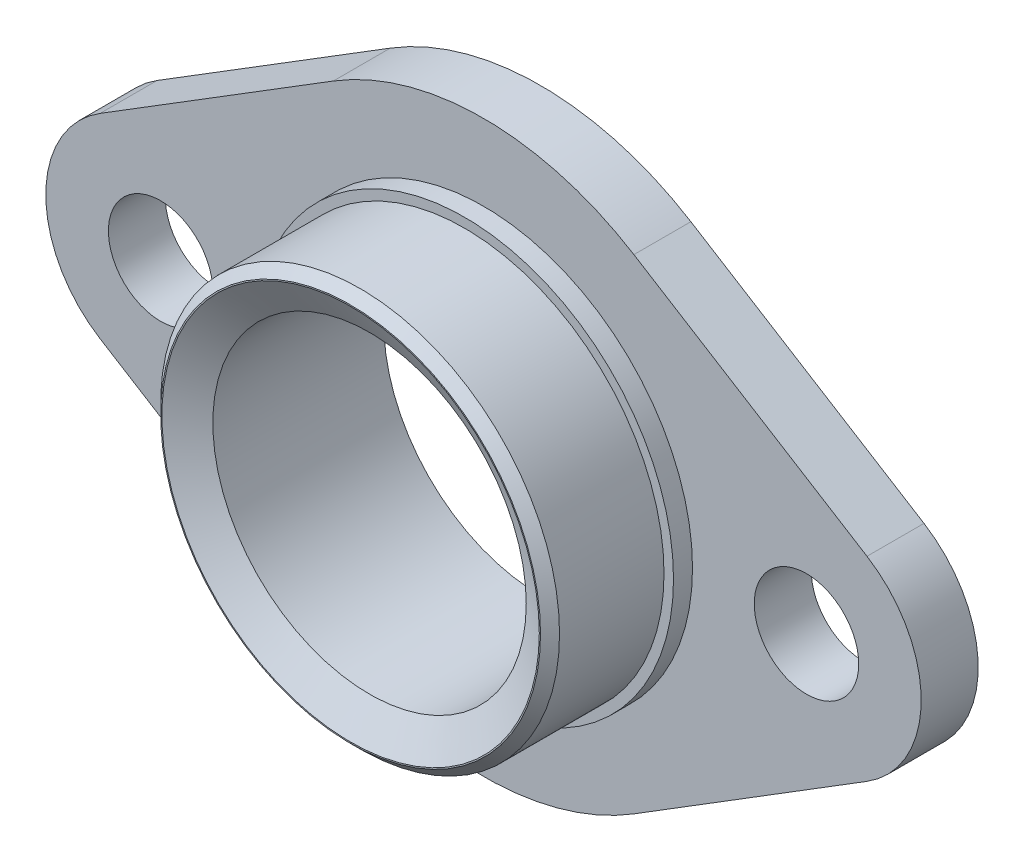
ISO-10303-21;
HEADER;
FILE_DESCRIPTION(('STEP AP214'),'2;1');
FILE_NAME('part.step','',(''),(''),'','','');
FILE_SCHEMA(('AUTOMOTIVE_DESIGN { 1 0 10303 214 1 1 1 1 }'));
ENDSEC;
DATA;
#1=APPLICATION_CONTEXT('core data for automotive mechanical design processes');
#2=APPLICATION_PROTOCOL_DEFINITION('international standard','automotive_design',2000,#1);
#3=PRODUCT_CONTEXT('',#1,'mechanical');
#4=PRODUCT('Part','Part','',(#3));
#5=PRODUCT_RELATED_PRODUCT_CATEGORY('part','',(#4));
#6=PRODUCT_DEFINITION_FORMATION('','',#4);
#7=PRODUCT_DEFINITION_CONTEXT('part definition',#1,'design');
#8=PRODUCT_DEFINITION('design','',#6,#7);
#9=PRODUCT_DEFINITION_SHAPE('','',#8);
#10=(LENGTH_UNIT() NAMED_UNIT(*) SI_UNIT(.MILLI.,.METRE.));
#11=(NAMED_UNIT(*) PLANE_ANGLE_UNIT() SI_UNIT($,.RADIAN.));
#12=(NAMED_UNIT(*) SI_UNIT($,.STERADIAN.) SOLID_ANGLE_UNIT());
#13=UNCERTAINTY_MEASURE_WITH_UNIT(LENGTH_MEASURE(1.E-05),#10,'distance_accuracy_value','');
#14=(GEOMETRIC_REPRESENTATION_CONTEXT(3) GLOBAL_UNCERTAINTY_ASSIGNED_CONTEXT((#13)) GLOBAL_UNIT_ASSIGNED_CONTEXT((#10,
#11,#12)) REPRESENTATION_CONTEXT('',''));
#15=CARTESIAN_POINT('',(0.,0.,0.));
#16=DIRECTION('',(0.,0.,1.));
#17=DIRECTION('',(1.,0.,0.));
#18=AXIS2_PLACEMENT_3D('',#15,#16,#17);
#19=CARTESIAN_POINT('',(0.,0.,6.));
#20=DIRECTION('',(0.,0.,-1.));
#21=DIRECTION('',(-1.,0.,0.));
#22=AXIS2_PLACEMENT_3D('',#19,#20,#21);
#23=CYLINDRICAL_SURFACE('',#22,16.5);
#24=CARTESIAN_POINT('',(0.,0.,0.));
#25=DIRECTION('',(0.,0.,1.));
#26=DIRECTION('',(1.,0.,0.));
#27=AXIS2_PLACEMENT_3D('',#24,#25,#26);
#28=CIRCLE('',#27,16.5);
#29=CARTESIAN_POINT('',(16.5,0.,0.));
#30=VERTEX_POINT('',#29);
#31=EDGE_CURVE('E388',#30,#30,#28,.T.);
#32=ORIENTED_EDGE('',*,*,#31,.F.);
#33=EDGE_LOOP('',(#32));
#34=FACE_BOUND('',#33,.T.);
#35=CARTESIAN_POINT('',(0.,0.,18.0047990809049));
#36=DIRECTION('',(0.,0.,1.));
#37=DIRECTION('',(1.,0.,0.));
#38=AXIS2_PLACEMENT_3D('',#35,#36,#37);
#39=CIRCLE('',#38,16.5);
#40=CARTESIAN_POINT('',(16.5,0.,18.0047990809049));
#41=VERTEX_POINT('',#40);
#42=EDGE_CURVE('E409',#41,#41,#39,.T.);
#43=ORIENTED_EDGE('',*,*,#42,.T.);
#44=EDGE_LOOP('',(#43));
#45=FACE_BOUND('',#44,.T.);
#46=ADVANCED_FACE('F31',(#34,#45),#23,.F.);
#47=CARTESIAN_POINT('',(0.,0.,20.));
#48=DIRECTION('',(0.,0.,1.));
#49=DIRECTION('',(1.,0.,0.));
#50=AXIS2_PLACEMENT_3D('',#47,#48,#49);
#51=PLANE('',#50);
#52=CARTESIAN_POINT('',(0.,0.,20.));
#53=DIRECTION('',(0.,0.,1.));
#54=DIRECTION('',(1.,0.,0.));
#55=AXIS2_PLACEMENT_3D('',#52,#53,#54);
#56=CIRCLE('',#55,20.);
#57=CARTESIAN_POINT('',(20.,0.,20.));
#58=VERTEX_POINT('',#57);
#59=EDGE_CURVE('E40',#58,#58,#56,.T.);
#60=ORIENTED_EDGE('',*,*,#59,.T.);
#61=EDGE_LOOP('',(#60));
#62=FACE_BOUND('',#61,.T.);
#63=CARTESIAN_POINT('',(0.,0.,20.));
#64=DIRECTION('',(0.,0.,1.));
#65=DIRECTION('',(1.,0.,0.));
#66=AXIS2_PLACEMENT_3D('',#63,#64,#65);
#67=CIRCLE('',#66,19.8680373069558);
#68=CARTESIAN_POINT('',(19.8680373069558,0.,20.));
#69=VERTEX_POINT('',#68);
#70=EDGE_CURVE('E35',#69,#69,#67,.F.);
#71=ORIENTED_EDGE('',*,*,#70,.T.);
#72=EDGE_LOOP('',(#71));
#73=FACE_BOUND('',#72,.T.);
#74=ADVANCED_FACE('F171',(#62,#73),#51,.T.);
#75=CARTESIAN_POINT('',(0.,0.,8.));
#76=DIRECTION('',(0.,0.,1.));
#77=DIRECTION('',(1.,0.,0.));
#78=AXIS2_PLACEMENT_3D('',#75,#76,#77);
#79=PLANE('',#78);
#80=CARTESIAN_POINT('',(0.,0.,8.));
#81=DIRECTION('',(0.,0.,1.));
#82=DIRECTION('',(1.,0.,0.));
#83=AXIS2_PLACEMENT_3D('',#80,#81,#82);
#84=CIRCLE('',#83,22.);
#85=CARTESIAN_POINT('',(22.,0.,8.));
#86=VERTEX_POINT('',#85);
#87=EDGE_CURVE('E381',#86,#86,#84,.T.);
#88=ORIENTED_EDGE('',*,*,#87,.T.);
#89=EDGE_LOOP('',(#88));
#90=FACE_BOUND('',#89,.T.);
#91=CARTESIAN_POINT('',(0.,0.,8.));
#92=DIRECTION('',(0.,0.,1.));
#93=DIRECTION('',(1.,0.,0.));
#94=AXIS2_PLACEMENT_3D('',#91,#92,#93);
#95=CIRCLE('',#94,21.);
#96=CARTESIAN_POINT('',(21.,0.,8.));
#97=VERTEX_POINT('',#96);
#98=EDGE_CURVE('E386',#97,#97,#95,.T.);
#99=ORIENTED_EDGE('',*,*,#98,.F.);
#100=EDGE_LOOP('',(#99));
#101=FACE_BOUND('',#100,.T.);
#102=ADVANCED_FACE('F197',(#90,#101),#79,.T.);
#103=CARTESIAN_POINT('',(34.,0.,6.));
#104=DIRECTION('',(0.,0.,1.));
#105=DIRECTION('',(1.,0.,0.));
#106=AXIS2_PLACEMENT_3D('',#103,#104,#105);
#107=PLANE('',#106);
#108=CARTESIAN_POINT('',(-34.,0.,6.));
#109=DIRECTION('',(0.,0.,1.));
#110=DIRECTION('',(1.,0.,0.));
#111=AXIS2_PLACEMENT_3D('',#108,#109,#110);
#112=CIRCLE('',#111,5.5);
#113=CARTESIAN_POINT('',(-28.5,0.,6.));
#114=VERTEX_POINT('',#113);
#115=EDGE_CURVE('E120',#114,#114,#112,.T.);
#116=ORIENTED_EDGE('',*,*,#115,.F.);
#117=EDGE_LOOP('',(#116));
#118=FACE_BOUND('',#117,.T.);
#119=CARTESIAN_POINT('',(34.,0.,6.));
#120=DIRECTION('',(0.,0.,1.));
#121=DIRECTION('',(1.,0.,0.));
#122=AXIS2_PLACEMENT_3D('',#119,#120,#121);
#123=CIRCLE('',#122,12.0790076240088);
#124=CARTESIAN_POINT('',(40.3705967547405,-10.2624520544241,6.));
#125=VERTEX_POINT('',#124);
#126=CARTESIAN_POINT('',(40.3705967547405,10.2624520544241,6.));
#127=VERTEX_POINT('',#126);
#128=EDGE_CURVE('E138',#125,#127,#123,.T.);
#129=ORIENTED_EDGE('',*,*,#128,.T.);
#130=DIRECTION('',(-0.849610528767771,0.527410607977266,0.));
#131=VECTOR('',#130,1.);
#132=CARTESIAN_POINT('',(15.8281030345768,25.4976346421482,6.));
#133=LINE('',#132,#131);
#134=CARTESIAN_POINT('',(15.8281030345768,25.4976346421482,6.));
#135=VERTEX_POINT('',#134);
#136=EDGE_CURVE('E113',#127,#135,#133,.T.);
#137=ORIENTED_EDGE('',*,*,#136,.T.);
#138=CARTESIAN_POINT('',(0.,0.,6.));
#139=DIRECTION('',(0.,0.,1.));
#140=DIRECTION('',(1.,0.,0.));
#141=AXIS2_PLACEMENT_3D('',#138,#139,#140);
#142=CIRCLE('',#141,30.0109682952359);
#143=CARTESIAN_POINT('',(-15.8176131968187,25.504143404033,6.));
#144=VERTEX_POINT('',#143);
#145=EDGE_CURVE('E141',#135,#144,#142,.T.);
#146=ORIENTED_EDGE('',*,*,#145,.T.);
#147=DIRECTION('',(-0.849827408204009,-0.527061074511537,0.));
#148=VECTOR('',#147,1.);
#149=CARTESIAN_POINT('',(-15.8176131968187,25.504143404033,6.));
#150=LINE('',#149,#148);
#151=CARTESIAN_POINT('',(-40.3726384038,10.2751712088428,6.));
#152=VERTEX_POINT('',#151);
#153=EDGE_CURVE('E143',#144,#152,#150,.T.);
#154=ORIENTED_EDGE('',*,*,#153,.T.);
#155=CARTESIAN_POINT('',(-34.,0.,6.));
#156=DIRECTION('',(0.,0.,1.));
#157=DIRECTION('',(1.,0.,0.));
#158=AXIS2_PLACEMENT_3D('',#155,#156,#157);
#159=CIRCLE('',#158,12.0908917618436);
#160=CARTESIAN_POINT('',(-40.3726384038,-10.2751712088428,6.));
#161=VERTEX_POINT('',#160);
#162=EDGE_CURVE('E145',#152,#161,#159,.T.);
#163=ORIENTED_EDGE('',*,*,#162,.T.);
#164=DIRECTION('',(0.849827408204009,-0.527061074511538,0.));
#165=VECTOR('',#164,1.);
#166=CARTESIAN_POINT('',(-15.8176131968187,-25.504143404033,6.));
#167=LINE('',#166,#165);
#168=CARTESIAN_POINT('',(-15.8176131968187,-25.504143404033,6.));
#169=VERTEX_POINT('',#168);
#170=EDGE_CURVE('E147',#161,#169,#167,.T.);
#171=ORIENTED_EDGE('',*,*,#170,.T.);
#172=CARTESIAN_POINT('',(0.,0.,6.));
#173=DIRECTION('',(0.,0.,1.));
#174=DIRECTION('',(-1.,0.,0.));
#175=AXIS2_PLACEMENT_3D('',#172,#173,#174);
#176=CIRCLE('',#175,30.0109682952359);
#177=CARTESIAN_POINT('',(15.8281030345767,-25.4976346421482,6.));
#178=VERTEX_POINT('',#177);
#179=EDGE_CURVE('E52',#169,#178,#176,.T.);
#180=ORIENTED_EDGE('',*,*,#179,.T.);
#181=DIRECTION('',(0.849610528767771,0.527410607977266,0.));
#182=VECTOR('',#181,1.);
#183=CARTESIAN_POINT('',(15.8281030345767,-25.4976346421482,6.));
#184=LINE('',#183,#182);
#185=EDGE_CURVE('E47',#178,#125,#184,.T.);
#186=ORIENTED_EDGE('',*,*,#185,.T.);
#187=EDGE_LOOP('',(#129,#137,#146,#154,#163,#171,#180,#186));
#188=FACE_BOUND('',#187,.T.);
#189=CARTESIAN_POINT('',(34.,0.,6.));
#190=DIRECTION('',(0.,0.,1.));
#191=DIRECTION('',(1.,0.,0.));
#192=AXIS2_PLACEMENT_3D('',#189,#190,#191);
#193=CIRCLE('',#192,5.5);
#194=CARTESIAN_POINT('',(39.5,0.,6.));
#195=VERTEX_POINT('',#194);
#196=EDGE_CURVE('E399',#195,#195,#193,.T.);
#197=ORIENTED_EDGE('',*,*,#196,.F.);
#198=EDGE_LOOP('',(#197));
#199=FACE_BOUND('',#198,.T.);
#200=CARTESIAN_POINT('',(0.,0.,6.));
#201=DIRECTION('',(0.,0.,1.));
#202=DIRECTION('',(1.,0.,0.));
#203=AXIS2_PLACEMENT_3D('',#200,#201,#202);
#204=CIRCLE('',#203,22.);
#205=CARTESIAN_POINT('',(22.,0.,6.));
#206=VERTEX_POINT('',#205);
#207=EDGE_CURVE('E384',#206,#206,#204,.T.);
#208=ORIENTED_EDGE('',*,*,#207,.F.);
#209=EDGE_LOOP('',(#208));
#210=FACE_BOUND('',#209,.T.);
#211=ADVANCED_FACE('F214',(#118,#188,#199,#210),#107,.T.);
#212=CARTESIAN_POINT('',(34.,0.,0.));
#213=DIRECTION('',(0.,0.,1.));
#214=DIRECTION('',(1.,0.,0.));
#215=AXIS2_PLACEMENT_3D('',#212,#213,#214);
#216=PLANE('',#215);
#217=CARTESIAN_POINT('',(34.,0.,0.));
#218=DIRECTION('',(0.,0.,1.));
#219=DIRECTION('',(1.,0.,0.));
#220=AXIS2_PLACEMENT_3D('',#217,#218,#219);
#221=CIRCLE('',#220,5.5);
#222=CARTESIAN_POINT('',(39.5,0.,0.));
#223=VERTEX_POINT('',#222);
#224=EDGE_CURVE('E396',#223,#223,#221,.T.);
#225=ORIENTED_EDGE('',*,*,#224,.T.);
#226=EDGE_LOOP('',(#225));
#227=FACE_BOUND('',#226,.T.);
#228=CARTESIAN_POINT('',(34.,0.,0.));
#229=DIRECTION('',(0.,0.,1.));
#230=DIRECTION('',(1.,0.,0.));
#231=AXIS2_PLACEMENT_3D('',#228,#229,#230);
#232=CIRCLE('',#231,12.0790076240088);
#233=CARTESIAN_POINT('',(40.3705967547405,-10.2624520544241,0.));
#234=VERTEX_POINT('',#233);
#235=CARTESIAN_POINT('',(40.3705967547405,10.2624520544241,0.));
#236=VERTEX_POINT('',#235);
#237=EDGE_CURVE('E103',#234,#236,#232,.T.);
#238=ORIENTED_EDGE('',*,*,#237,.F.);
#239=DIRECTION('',(0.849610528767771,0.527410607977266,0.));
#240=VECTOR('',#239,1.);
#241=CARTESIAN_POINT('',(15.8281030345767,-25.4976346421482,0.));
#242=LINE('',#241,#240);
#243=CARTESIAN_POINT('',(15.8281030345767,-25.4976346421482,0.));
#244=VERTEX_POINT('',#243);
#245=EDGE_CURVE('E136',#244,#234,#242,.T.);
#246=ORIENTED_EDGE('',*,*,#245,.F.);
#247=CARTESIAN_POINT('',(0.,0.,0.));
#248=DIRECTION('',(0.,0.,1.));
#249=DIRECTION('',(-1.,0.,0.));
#250=AXIS2_PLACEMENT_3D('',#247,#248,#249);
#251=CIRCLE('',#250,30.0109682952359);
#252=CARTESIAN_POINT('',(-15.8176131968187,-25.504143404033,0.));
#253=VERTEX_POINT('',#252);
#254=EDGE_CURVE('E134',#253,#244,#251,.T.);
#255=ORIENTED_EDGE('',*,*,#254,.F.);
#256=DIRECTION('',(0.849827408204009,-0.527061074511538,0.));
#257=VECTOR('',#256,1.);
#258=CARTESIAN_POINT('',(-15.8176131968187,-25.504143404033,0.));
#259=LINE('',#258,#257);
#260=CARTESIAN_POINT('',(-40.3726384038,-10.2751712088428,0.));
#261=VERTEX_POINT('',#260);
#262=EDGE_CURVE('E132',#261,#253,#259,.T.);
#263=ORIENTED_EDGE('',*,*,#262,.F.);
#264=CARTESIAN_POINT('',(-34.,0.,0.));
#265=DIRECTION('',(0.,0.,1.));
#266=DIRECTION('',(1.,0.,0.));
#267=AXIS2_PLACEMENT_3D('',#264,#265,#266);
#268=CIRCLE('',#267,12.0908917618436);
#269=CARTESIAN_POINT('',(-40.3726384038,10.2751712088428,0.));
#270=VERTEX_POINT('',#269);
#271=EDGE_CURVE('E130',#270,#261,#268,.T.);
#272=ORIENTED_EDGE('',*,*,#271,.F.);
#273=DIRECTION('',(-0.849827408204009,-0.527061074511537,0.));
#274=VECTOR('',#273,1.);
#275=CARTESIAN_POINT('',(-15.8176131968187,25.504143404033,0.));
#276=LINE('',#275,#274);
#277=CARTESIAN_POINT('',(-15.8176131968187,25.504143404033,0.));
#278=VERTEX_POINT('',#277);
#279=EDGE_CURVE('E128',#278,#270,#276,.T.);
#280=ORIENTED_EDGE('',*,*,#279,.F.);
#281=CARTESIAN_POINT('',(0.,0.,0.));
#282=DIRECTION('',(0.,0.,1.));
#283=DIRECTION('',(1.,0.,0.));
#284=AXIS2_PLACEMENT_3D('',#281,#282,#283);
#285=CIRCLE('',#284,30.0109682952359);
#286=CARTESIAN_POINT('',(15.8281030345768,25.4976346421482,0.));
#287=VERTEX_POINT('',#286);
#288=EDGE_CURVE('E105',#287,#278,#285,.T.);
#289=ORIENTED_EDGE('',*,*,#288,.F.);
#290=DIRECTION('',(-0.849610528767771,0.527410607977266,0.));
#291=VECTOR('',#290,1.);
#292=CARTESIAN_POINT('',(15.8281030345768,25.4976346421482,0.));
#293=LINE('',#292,#291);
#294=EDGE_CURVE('E97',#236,#287,#293,.T.);
#295=ORIENTED_EDGE('',*,*,#294,.F.);
#296=EDGE_LOOP('',(#238,#246,#255,#263,#272,#280,#289,#295));
#297=FACE_BOUND('',#296,.T.);
#298=CARTESIAN_POINT('',(-34.,0.,0.));
#299=DIRECTION('',(0.,0.,1.));
#300=DIRECTION('',(1.,0.,0.));
#301=AXIS2_PLACEMENT_3D('',#298,#299,#300);
#302=CIRCLE('',#301,5.5);
#303=CARTESIAN_POINT('',(-28.5,0.,0.));
#304=VERTEX_POINT('',#303);
#305=EDGE_CURVE('E123',#304,#304,#302,.T.);
#306=ORIENTED_EDGE('',*,*,#305,.T.);
#307=EDGE_LOOP('',(#306));
#308=FACE_BOUND('',#307,.T.);
#309=ORIENTED_EDGE('',*,*,#31,.T.);
#310=EDGE_LOOP('',(#309));
#311=FACE_BOUND('',#310,.T.);
#312=ADVANCED_FACE('F99',(#227,#297,#308,#311),#216,.F.);
#313=CARTESIAN_POINT('',(34.,0.,6.));
#314=DIRECTION('',(0.,0.,-1.));
#315=DIRECTION('',(-1.,0.,0.));
#316=AXIS2_PLACEMENT_3D('',#313,#314,#315);
#317=CYLINDRICAL_SURFACE('',#316,12.0790076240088);
#318=ORIENTED_EDGE('',*,*,#237,.T.);
#319=DIRECTION('',(0.,0.,-1.));
#320=VECTOR('',#319,1.);
#321=CARTESIAN_POINT('',(40.3705967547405,10.2624520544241,6.));
#322=LINE('',#321,#320);
#323=EDGE_CURVE('E111',#127,#236,#322,.T.);
#324=ORIENTED_EDGE('',*,*,#323,.F.);
#325=ORIENTED_EDGE('',*,*,#128,.F.);
#326=DIRECTION('',(0.,0.,-1.));
#327=VECTOR('',#326,1.);
#328=CARTESIAN_POINT('',(40.3705967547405,-10.2624520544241,6.));
#329=LINE('',#328,#327);
#330=EDGE_CURVE('E119',#125,#234,#329,.T.);
#331=ORIENTED_EDGE('',*,*,#330,.T.);
#332=EDGE_LOOP('',(#318,#324,#325,#331));
#333=FACE_BOUND('',#332,.T.);
#334=ADVANCED_FACE('F33',(#333),#317,.T.);
#335=CARTESIAN_POINT('',(15.8281030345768,25.4976346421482,6.));
#336=DIRECTION('',(-0.527410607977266,-0.84961052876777,0.));
#337=DIRECTION('',(0.849610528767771,-0.527410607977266,0.));
#338=AXIS2_PLACEMENT_3D('',#335,#336,#337);
#339=PLANE('',#338);
#340=ORIENTED_EDGE('',*,*,#294,.T.);
#341=DIRECTION('',(0.,0.,-1.));
#342=VECTOR('',#341,1.);
#343=CARTESIAN_POINT('',(15.8281030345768,25.4976346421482,6.));
#344=LINE('',#343,#342);
#345=EDGE_CURVE('E116',#135,#287,#344,.T.);
#346=ORIENTED_EDGE('',*,*,#345,.F.);
#347=ORIENTED_EDGE('',*,*,#136,.F.);
#348=ORIENTED_EDGE('',*,*,#323,.T.);
#349=EDGE_LOOP('',(#340,#346,#347,#348));
#350=FACE_BOUND('',#349,.T.);
#351=ADVANCED_FACE('F112',(#350),#339,.F.);
#352=CARTESIAN_POINT('',(0.,0.,6.));
#353=DIRECTION('',(0.,0.,-1.));
#354=DIRECTION('',(-1.,0.,0.));
#355=AXIS2_PLACEMENT_3D('',#352,#353,#354);
#356=CYLINDRICAL_SURFACE('',#355,30.0109682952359);
#357=ORIENTED_EDGE('',*,*,#288,.T.);
#358=DIRECTION('',(0.,0.,-1.));
#359=VECTOR('',#358,1.);
#360=CARTESIAN_POINT('',(-15.8176131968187,25.504143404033,6.));
#361=LINE('',#360,#359);
#362=EDGE_CURVE('E164',#144,#278,#361,.T.);
#363=ORIENTED_EDGE('',*,*,#362,.F.);
#364=ORIENTED_EDGE('',*,*,#145,.F.);
#365=ORIENTED_EDGE('',*,*,#345,.T.);
#366=EDGE_LOOP('',(#357,#363,#364,#365));
#367=FACE_BOUND('',#366,.T.);
#368=ADVANCED_FACE('F237',(#367),#356,.T.);
#369=CARTESIAN_POINT('',(-15.8176131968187,25.504143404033,6.));
#370=DIRECTION('',(0.527061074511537,-0.849827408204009,0.));
#371=DIRECTION('',(0.849827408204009,0.527061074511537,0.));
#372=AXIS2_PLACEMENT_3D('',#369,#370,#371);
#373=PLANE('',#372);
#374=ORIENTED_EDGE('',*,*,#279,.T.);
#375=DIRECTION('',(0.,0.,-1.));
#376=VECTOR('',#375,1.);
#377=CARTESIAN_POINT('',(-40.3726384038,10.2751712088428,6.));
#378=LINE('',#377,#376);
#379=EDGE_CURVE('E161',#152,#270,#378,.T.);
#380=ORIENTED_EDGE('',*,*,#379,.F.);
#381=ORIENTED_EDGE('',*,*,#153,.F.);
#382=ORIENTED_EDGE('',*,*,#362,.T.);
#383=EDGE_LOOP('',(#374,#380,#381,#382));
#384=FACE_BOUND('',#383,.T.);
#385=ADVANCED_FACE('F233',(#384),#373,.F.);
#386=CARTESIAN_POINT('',(-34.,0.,6.));
#387=DIRECTION('',(0.,0.,-1.));
#388=DIRECTION('',(-1.,0.,0.));
#389=AXIS2_PLACEMENT_3D('',#386,#387,#388);
#390=CYLINDRICAL_SURFACE('',#389,12.0908917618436);
#391=ORIENTED_EDGE('',*,*,#271,.T.);
#392=DIRECTION('',(0.,0.,-1.));
#393=VECTOR('',#392,1.);
#394=CARTESIAN_POINT('',(-40.3726384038,-10.2751712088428,6.));
#395=LINE('',#394,#393);
#396=EDGE_CURVE('E158',#161,#261,#395,.T.);
#397=ORIENTED_EDGE('',*,*,#396,.F.);
#398=ORIENTED_EDGE('',*,*,#162,.F.);
#399=ORIENTED_EDGE('',*,*,#379,.T.);
#400=EDGE_LOOP('',(#391,#397,#398,#399));
#401=FACE_BOUND('',#400,.T.);
#402=ADVANCED_FACE('F229',(#401),#390,.T.);
#403=CARTESIAN_POINT('',(-15.8176131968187,-25.504143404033,6.));
#404=DIRECTION('',(0.527061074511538,0.849827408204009,0.));
#405=DIRECTION('',(-0.849827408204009,0.527061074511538,0.));
#406=AXIS2_PLACEMENT_3D('',#403,#404,#405);
#407=PLANE('',#406);
#408=ORIENTED_EDGE('',*,*,#262,.T.);
#409=DIRECTION('',(0.,0.,-1.));
#410=VECTOR('',#409,1.);
#411=CARTESIAN_POINT('',(-15.8176131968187,-25.504143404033,6.));
#412=LINE('',#411,#410);
#413=EDGE_CURVE('E155',#169,#253,#412,.T.);
#414=ORIENTED_EDGE('',*,*,#413,.F.);
#415=ORIENTED_EDGE('',*,*,#170,.F.);
#416=ORIENTED_EDGE('',*,*,#396,.T.);
#417=EDGE_LOOP('',(#408,#414,#415,#416));
#418=FACE_BOUND('',#417,.T.);
#419=ADVANCED_FACE('F225',(#418),#407,.F.);
#420=CARTESIAN_POINT('',(0.,0.,6.));
#421=DIRECTION('',(0.,0.,-1.));
#422=DIRECTION('',(-1.,0.,0.));
#423=AXIS2_PLACEMENT_3D('',#420,#421,#422);
#424=CYLINDRICAL_SURFACE('',#423,30.0109682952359);
#425=ORIENTED_EDGE('',*,*,#254,.T.);
#426=DIRECTION('',(0.,0.,-1.));
#427=VECTOR('',#426,1.);
#428=CARTESIAN_POINT('',(15.8281030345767,-25.4976346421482,6.));
#429=LINE('',#428,#427);
#430=EDGE_CURVE('E152',#178,#244,#429,.T.);
#431=ORIENTED_EDGE('',*,*,#430,.F.);
#432=ORIENTED_EDGE('',*,*,#179,.F.);
#433=ORIENTED_EDGE('',*,*,#413,.T.);
#434=EDGE_LOOP('',(#425,#431,#432,#433));
#435=FACE_BOUND('',#434,.T.);
#436=ADVANCED_FACE('F221',(#435),#424,.T.);
#437=CARTESIAN_POINT('',(15.8281030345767,-25.4976346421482,6.));
#438=DIRECTION('',(-0.527410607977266,0.84961052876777,0.));
#439=DIRECTION('',(-0.849610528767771,-0.527410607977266,0.));
#440=AXIS2_PLACEMENT_3D('',#437,#438,#439);
#441=PLANE('',#440);
#442=ORIENTED_EDGE('',*,*,#245,.T.);
#443=ORIENTED_EDGE('',*,*,#330,.F.);
#444=ORIENTED_EDGE('',*,*,#185,.F.);
#445=ORIENTED_EDGE('',*,*,#430,.T.);
#446=EDGE_LOOP('',(#442,#443,#444,#445));
#447=FACE_BOUND('',#446,.T.);
#448=ADVANCED_FACE('F210',(#447),#441,.F.);
#449=CARTESIAN_POINT('',(-34.,0.,6.));
#450=DIRECTION('',(0.,0.,-1.));
#451=DIRECTION('',(-1.,0.,0.));
#452=AXIS2_PLACEMENT_3D('',#449,#450,#451);
#453=CYLINDRICAL_SURFACE('',#452,5.5);
#454=ORIENTED_EDGE('',*,*,#115,.T.);
#455=EDGE_LOOP('',(#454));
#456=FACE_BOUND('',#455,.T.);
#457=ORIENTED_EDGE('',*,*,#305,.F.);
#458=EDGE_LOOP('',(#457));
#459=FACE_BOUND('',#458,.T.);
#460=ADVANCED_FACE('F206',(#456,#459),#453,.F.);
#461=CARTESIAN_POINT('',(34.,0.,6.));
#462=DIRECTION('',(0.,0.,-1.));
#463=DIRECTION('',(-1.,0.,0.));
#464=AXIS2_PLACEMENT_3D('',#461,#462,#463);
#465=CYLINDRICAL_SURFACE('',#464,5.5);
#466=ORIENTED_EDGE('',*,*,#196,.T.);
#467=EDGE_LOOP('',(#466));
#468=FACE_BOUND('',#467,.T.);
#469=ORIENTED_EDGE('',*,*,#224,.F.);
#470=EDGE_LOOP('',(#469));
#471=FACE_BOUND('',#470,.T.);
#472=ADVANCED_FACE('F203',(#468,#471),#465,.F.);
#473=CARTESIAN_POINT('',(0.,0.,8.));
#474=DIRECTION('',(0.,0.,-1.));
#475=DIRECTION('',(-1.,0.,0.));
#476=AXIS2_PLACEMENT_3D('',#473,#474,#475);
#477=CYLINDRICAL_SURFACE('',#476,22.);
#478=ORIENTED_EDGE('',*,*,#87,.F.);
#479=EDGE_LOOP('',(#478));
#480=FACE_BOUND('',#479,.T.);
#481=ORIENTED_EDGE('',*,*,#207,.T.);
#482=EDGE_LOOP('',(#481));
#483=FACE_BOUND('',#482,.T.);
#484=ADVANCED_FACE('F186',(#480,#483),#477,.T.);
#485=CARTESIAN_POINT('',(0.,0.,20.));
#486=DIRECTION('',(0.,0.,-1.));
#487=DIRECTION('',(-1.,0.,0.));
#488=AXIS2_PLACEMENT_3D('',#485,#486,#487);
#489=CYLINDRICAL_SURFACE('',#488,21.);
#490=CARTESIAN_POINT('',(0.,0.,19.));
#491=DIRECTION('',(0.,0.,1.));
#492=DIRECTION('',(1.,0.,0.));
#493=AXIS2_PLACEMENT_3D('',#490,#491,#492);
#494=CIRCLE('',#493,21.);
#495=CARTESIAN_POINT('',(21.,0.,19.));
#496=VERTEX_POINT('',#495);
#497=EDGE_CURVE('E11',#496,#496,#494,.F.);
#498=ORIENTED_EDGE('',*,*,#497,.T.);
#499=EDGE_LOOP('',(#498));
#500=FACE_BOUND('',#499,.T.);
#501=ORIENTED_EDGE('',*,*,#98,.T.);
#502=EDGE_LOOP('',(#501));
#503=FACE_BOUND('',#502,.T.);
#504=ADVANCED_FACE('F177',(#500,#503),#489,.T.);
#505=CARTESIAN_POINT('',(0.,0.,20.));
#506=DIRECTION('',(0.,0.,-1.));
#507=DIRECTION('',(-1.,0.,0.));
#508=AXIS2_PLACEMENT_3D('',#505,#506,#507);
#509=CONICAL_SURFACE('',#508,20.,0.785398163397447);
#510=ORIENTED_EDGE('',*,*,#497,.F.);
#511=EDGE_LOOP('',(#510));
#512=FACE_BOUND('',#511,.T.);
#513=ORIENTED_EDGE('',*,*,#59,.F.);
#514=EDGE_LOOP('',(#513));
#515=FACE_BOUND('',#514,.T.);
#516=ADVANCED_FACE('F174',(#512,#515),#509,.T.);
#517=CARTESIAN_POINT('',(0.,0.,18.0047990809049));
#518=DIRECTION('',(0.,0.,1.));
#519=DIRECTION('',(1.,0.,0.));
#520=AXIS2_PLACEMENT_3D('',#517,#518,#519);
#521=CONICAL_SURFACE('',#520,16.5,1.03598916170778);
#522=ORIENTED_EDGE('',*,*,#70,.F.);
#523=EDGE_LOOP('',(#522));
#524=FACE_BOUND('',#523,.T.);
#525=ORIENTED_EDGE('',*,*,#42,.F.);
#526=EDGE_LOOP('',(#525));
#527=FACE_BOUND('',#526,.T.);
#528=ADVANCED_FACE('F176',(#524,#527),#521,.F.);
#529=CLOSED_SHELL('',(#46,#74,#102,#211,#312,#334,#351,#368,#385,#402,#419,#436,#448,#460,#472,
#484,#504,#516,#528));
#530=MANIFOLD_SOLID_BREP('B2',#529);
#531=ADVANCED_BREP_SHAPE_REPRESENTATION('',(#18,#530),#14);
#532=SHAPE_DEFINITION_REPRESENTATION(#9,#531);
ENDSEC;
END-ISO-10303-21;
